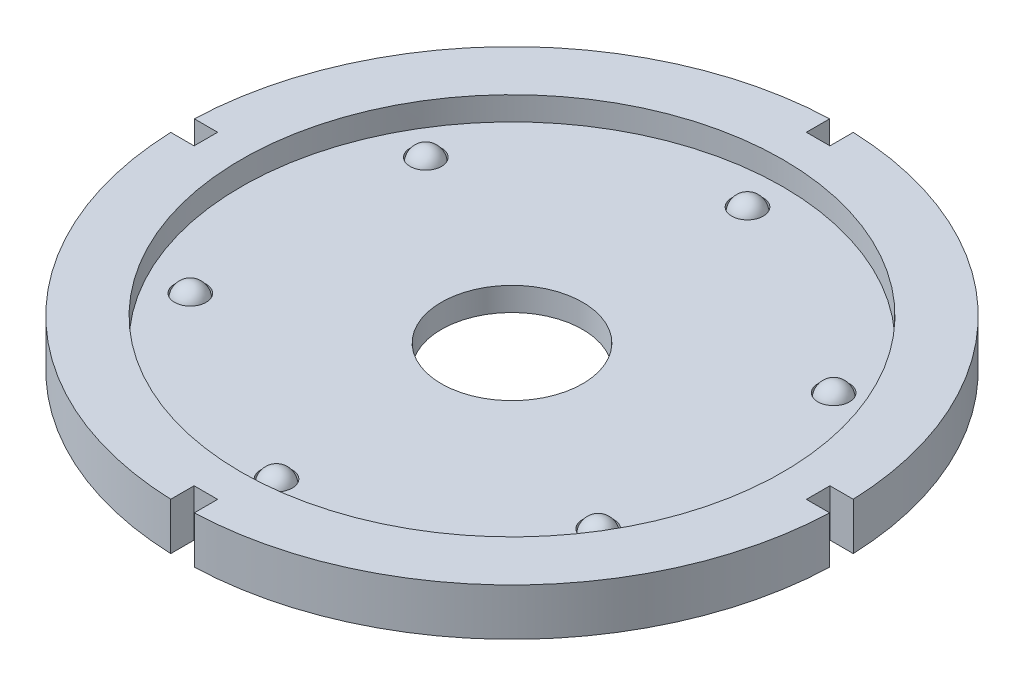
from build123d import *

# Parameters (mm, degrees)
CROQUIS2_R                 = 70
CROQUIS2_R_2               = 57.5
SALIENTE_EXTRUIR1_DEPTH    = 10
CROQUIS3_R                 = 57.5
SALIENTE_EXTRUIR2_DEPTH    = 5
CORTAR_EXTRUIR1_REACH      = 101.121
CROQUIS7_R                 = 15
MATRIZC2_COUNT             = 6
MATRIZC5_COUNT             = 6
CORTAR_EXTRUIR2_DEPTH      = 100.498743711
CORTAR_EXTRUIR2_DEPTH_BACK = 100.498743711


with BuildPart() as part:
    # Croquis2 → Saliente-Extruir1 (new body)
    with BuildSketch(Plane(origin=(0, 0, 0), x_dir=(1, 0, 0), z_dir=(0, 1, 0))):
        with Locations(Location((0, 0, 0), (0, 0, 270))):
            Circle(CROQUIS2_R)
        with Locations(Location((0, 0, 0), (0, 0, 270))):
            Circle(CROQUIS2_R_2, mode=Mode.SUBTRACT)
    extrude(amount=SALIENTE_EXTRUIR1_DEPTH)

    # Croquis3 → Saliente-Extruir2 (add)
    with BuildSketch(Plane(origin=(0, 0, 0), x_dir=(-1, 0, 0), z_dir=(0, -1, 0))):
        with Locations(Location((0, 0, 0), (0, 0, 90))):
            Circle(CROQUIS3_R)
    extrude(amount=-SALIENTE_EXTRUIR2_DEPTH)

    # Croquis7 → Cortar-Extruir1 (cut, up to next)
    with BuildSketch(Plane(origin=(0, 5, 0), x_dir=(1, 0, 0), z_dir=(0, 1, 0)), mode=Mode.PRIVATE) as cortar_extruir1_sk1:
        with Locations(Location((0, 0, 0), (0, 0, 270))):
            Circle(CROQUIS7_R)
    cortar_extruir1_tool1 = extrude(cortar_extruir1_sk1.sketch, amount=-CORTAR_EXTRUIR1_REACH, mode=Mode.PRIVATE) & part.part
    add(cortar_extruir1_tool1.solids().sort_by_distance((0, 5, 0))[0], mode=Mode.SUBTRACT)

    # Croquis8 → Cortar-Revoluci_n2 (revolve, cut)
    with BuildSketch(Plane(origin=(0, 146.937450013, 12.321522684), x_dir=(0, 0, -1), z_dir=(1, 0, 0))):
        with BuildLine():
            Line((-37.678477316, -139.437450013), (-37.678477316, -146.437450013))
            ThreePointArc((-37.678477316, -146.437450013), (-41.178477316, -142.937450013), (-37.678477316, -139.437450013))
        make_face()
    cortar_revoluci_n2 = revolve(axis=Axis((0, 7.5, 50), (0, -1, 0)), mode=Mode.SUBTRACT)

    # MatrizC2: Cortar-Revoluci_n2 ×6 about axis
    matrizc2_axis = Axis((0, 0, 0), (0, 1, 0))
    for i in range(1, MATRIZC2_COUNT):
        add(cortar_revoluci_n2.rotate(matrizc2_axis, i * 360 / MATRIZC2_COUNT), mode=Mode.SUBTRACT)

    # Croquis12 → Cortar-Extruir2 (cut, two sides: drawn at the far end of the back side and taken through both)
    with BuildSketch(Plane(origin=(0, 10, 0), x_dir=(1, 0, 0), z_dir=(0, 1, 0)).offset(-CORTAR_EXTRUIR2_DEPTH_BACK)):
        with BuildLine():
            Line((75, 2.5), (69.955342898, 2.5))
            ThreePointArc((69.955342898, 2.5), (69.988834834, 1.25019941), (70, 0))
            ThreePointArc((70, 0), (69.988834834, -1.25019941), (69.955342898, -2.5))
            Line((69.955342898, -2.5), (75, -2.5))
            Line((75, -2.5), (75, 2.5))
        make_face()
        with BuildLine():
            ThreePointArc((70, 0), (69.988834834, 1.25019941), (69.955342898, 2.5))
            Line((69.955342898, 2.5), (65, 2.5))
            Line((65, 2.5), (65, -2.5))
            Line((65, -2.5), (69.955342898, -2.5))
            ThreePointArc((69.955342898, -2.5), (69.988834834, -1.25019941), (70, 0))
        make_face()
        with BuildLine():
            Line((-2.5, -65), (-2.5, -69.955342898))
            ThreePointArc((-2.5, -69.955342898), (0, -70), (2.5, -69.955342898))
            Line((2.5, -69.955342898), (2.5, -65))
            Line((2.5, -65), (-2.5, -65))
        make_face()
        with BuildLine():
            ThreePointArc((2.5, -69.955342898), (0, -70), (-2.5, -69.955342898))
            Line((-2.5, -69.955342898), (-2.5, -75))
            Line((-2.5, -75), (2.5, -75))
            Line((2.5, -75), (2.5, -69.955342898))
        make_face()
        with BuildLine():
            ThreePointArc((-69.955342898, -2.5), (-70, 0), (-69.955342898, 2.5))
            Line((-69.955342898, 2.5), (-75, 2.5))
            Line((-75, 2.5), (-75, -2.5))
            Line((-75, -2.5), (-69.955342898, -2.5))
        make_face()
        with BuildLine():
            Line((-65, 2.5), (-69.955342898, 2.5))
            ThreePointArc((-69.955342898, 2.5), (-70, 0), (-69.955342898, -2.5))
            Line((-69.955342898, -2.5), (-65, -2.5))
            Line((-65, -2.5), (-65, 2.5))
        make_face()
        with BuildLine():
            Line((-2.5, 75), (-2.5, 69.955342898))
            ThreePointArc((-2.5, 69.955342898), (0, 70), (2.5, 69.955342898))
            Line((2.5, 69.955342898), (2.5, 75))
            Line((2.5, 75), (-2.5, 75))
        make_face()
        with BuildLine():
            Line((-2.5, 69.955342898), (-2.5, 65))
            Line((-2.5, 65), (2.5, 65))
            Line((2.5, 65), (2.5, 69.955342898))
            ThreePointArc((2.5, 69.955342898), (0, 70), (-2.5, 69.955342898))
        make_face()
    extrude(amount=CORTAR_EXTRUIR2_DEPTH + CORTAR_EXTRUIR2_DEPTH_BACK, mode=Mode.SUBTRACT)


with BuildPart() as body_2:
    # Croquis10 → Revoluci_n1 (revolve)
    with BuildSketch(Plane(origin=(0, 0, 0), x_dir=(0, 0, -1), z_dir=(1, 0, 0))):
        with BuildLine():
            Line((-50.007946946, 7.114179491), (-50.007946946, 0.614179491))
            ThreePointArc((-50.007946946, 0.614179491), (-53.257946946, 3.864179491), (-50.007946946, 7.114179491))
        make_face()
    revolve(axis=Axis((0, 7.114179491, 50.007946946), (0, -1, 0)))


with BuildPart() as matrizc5_1:
    # MatrizC5: pattern copy
    add(body_2.part.rotate(Axis((0, 0, 0), (0, 1, 0)), 1 * 360 / MATRIZC5_COUNT))


with BuildPart() as matrizc5_2:
    # MatrizC5: pattern copy
    add(body_2.part.rotate(Axis((0, 0, 0), (0, 1, 0)), 2 * 360 / MATRIZC5_COUNT))


with BuildPart() as matrizc5_3:
    # MatrizC5: pattern copy
    add(body_2.part.rotate(Axis((0, 0, 0), (0, 1, 0)), 3 * 360 / MATRIZC5_COUNT))


with BuildPart() as matrizc5_4:
    # MatrizC5: pattern copy
    add(body_2.part.rotate(Axis((0, 0, 0), (0, 1, 0)), 4 * 360 / MATRIZC5_COUNT))


with BuildPart() as matrizc5_5:
    # MatrizC5: pattern copy
    add(body_2.part.rotate(Axis((0, 0, 0), (0, 1, 0)), 5 * 360 / MATRIZC5_COUNT))


solid = Compound([part.part, body_2.part, matrizc5_1.part, matrizc5_2.part, matrizc5_3.part, matrizc5_4.part, matrizc5_5.part])
